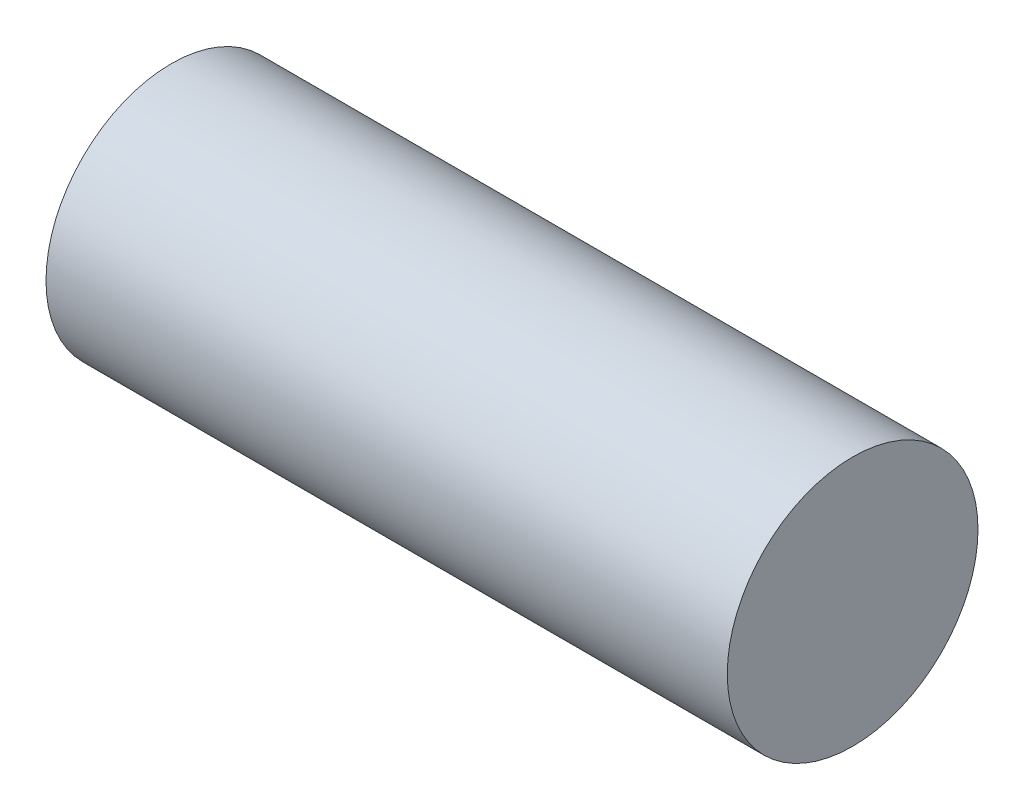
from build123d import *

# Parameters (mm, degrees)
SKETCH1_R           = 5.842
BOSS_EXTRUDE1_DEPTH = 31.75


with BuildPart() as part:
    # Sketch1 → Boss-Extrude1 (new body)
    with BuildSketch(Plane(origin=(0, 0, 0), x_dir=(0, 0, -1), z_dir=(1, 0, 0))):
        Circle(SKETCH1_R)
    extrude(amount=BOSS_EXTRUDE1_DEPTH)


solid = part.part
